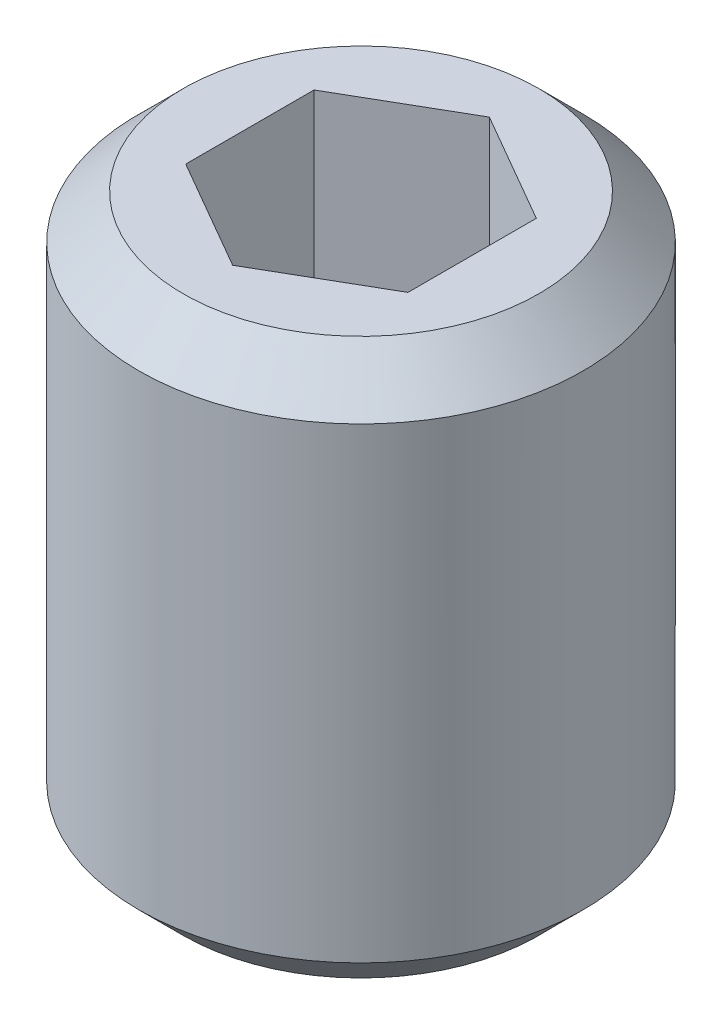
ISO-10303-21;
HEADER;
FILE_DESCRIPTION(('STEP AP214'),'2;1');
FILE_NAME('part.step','',(''),(''),'','','');
FILE_SCHEMA(('AUTOMOTIVE_DESIGN { 1 0 10303 214 1 1 1 1 }'));
ENDSEC;
DATA;
#1=APPLICATION_CONTEXT('core data for automotive mechanical design processes');
#2=APPLICATION_PROTOCOL_DEFINITION('international standard','automotive_design',2000,#1);
#3=PRODUCT_CONTEXT('',#1,'mechanical');
#4=PRODUCT('Part','Part','',(#3));
#5=PRODUCT_RELATED_PRODUCT_CATEGORY('part','',(#4));
#6=PRODUCT_DEFINITION_FORMATION('','',#4);
#7=PRODUCT_DEFINITION_CONTEXT('part definition',#1,'design');
#8=PRODUCT_DEFINITION('design','',#6,#7);
#9=PRODUCT_DEFINITION_SHAPE('','',#8);
#10=(LENGTH_UNIT() NAMED_UNIT(*) SI_UNIT(.MILLI.,.METRE.));
#11=(NAMED_UNIT(*) PLANE_ANGLE_UNIT() SI_UNIT($,.RADIAN.));
#12=(NAMED_UNIT(*) SI_UNIT($,.STERADIAN.) SOLID_ANGLE_UNIT());
#13=UNCERTAINTY_MEASURE_WITH_UNIT(LENGTH_MEASURE(1.E-05),#10,'distance_accuracy_value','');
#14=(GEOMETRIC_REPRESENTATION_CONTEXT(3) GLOBAL_UNCERTAINTY_ASSIGNED_CONTEXT((#13)) GLOBAL_UNIT_ASSIGNED_CONTEXT((#10,
#11,#12)) REPRESENTATION_CONTEXT('',''));
#15=CARTESIAN_POINT('',(0.,0.,0.));
#16=DIRECTION('',(0.,0.,1.));
#17=DIRECTION('',(1.,0.,0.));
#18=AXIS2_PLACEMENT_3D('',#15,#16,#17);
#19=CARTESIAN_POINT('',(0.,-10.,0.));
#20=DIRECTION('',(0.,1.,0.));
#21=DIRECTION('',(0.,0.,1.));
#22=AXIS2_PLACEMENT_3D('',#19,#20,#21);
#23=PLANE('',#22);
#24=CARTESIAN_POINT('',(0.,-10.,0.));
#25=DIRECTION('',(0.,1.,0.));
#26=DIRECTION('',(0.,0.,1.));
#27=AXIS2_PLACEMENT_3D('',#24,#25,#26);
#28=CIRCLE('',#27,3.2);
#29=CARTESIAN_POINT('',(0.,-10.,3.2));
#30=VERTEX_POINT('',#29);
#31=EDGE_CURVE('E147',#30,#30,#28,.F.);
#32=ORIENTED_EDGE('',*,*,#31,.T.);
#33=EDGE_LOOP('',(#32));
#34=FACE_BOUND('',#33,.T.);
#35=ADVANCED_FACE('F37',(#34),#23,.F.);
#36=CARTESIAN_POINT('',(0.,0.,0.));
#37=DIRECTION('',(0.,1.,0.));
#38=DIRECTION('',(0.,0.,1.));
#39=AXIS2_PLACEMENT_3D('',#36,#37,#38);
#40=CYLINDRICAL_SURFACE('',#39,4.);
#41=CARTESIAN_POINT('',(0.,-0.800000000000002,0.));
#42=DIRECTION('',(0.,-1.,0.));
#43=DIRECTION('',(0.,0.,-1.));
#44=AXIS2_PLACEMENT_3D('',#41,#42,#43);
#45=CIRCLE('',#44,4.);
#46=CARTESIAN_POINT('',(0.,-0.800000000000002,-4.));
#47=VERTEX_POINT('',#46);
#48=EDGE_CURVE('E11',#47,#47,#45,.T.);
#49=ORIENTED_EDGE('',*,*,#48,.T.);
#50=EDGE_LOOP('',(#49));
#51=FACE_BOUND('',#50,.T.);
#52=CARTESIAN_POINT('',(0.,-9.2,0.));
#53=DIRECTION('',(0.,1.,0.));
#54=DIRECTION('',(0.,0.,1.));
#55=AXIS2_PLACEMENT_3D('',#52,#53,#54);
#56=CIRCLE('',#55,4.);
#57=CARTESIAN_POINT('',(0.,-9.2,4.));
#58=VERTEX_POINT('',#57);
#59=EDGE_CURVE('E139',#58,#58,#56,.T.);
#60=ORIENTED_EDGE('',*,*,#59,.T.);
#61=EDGE_LOOP('',(#60));
#62=FACE_BOUND('',#61,.T.);
#63=ADVANCED_FACE('F167',(#51,#62),#40,.T.);
#64=CARTESIAN_POINT('',(0.,0.,0.));
#65=DIRECTION('',(0.,-1.,0.));
#66=DIRECTION('',(0.,0.,-1.));
#67=AXIS2_PLACEMENT_3D('',#64,#65,#66);
#68=PLANE('',#67);
#69=DIRECTION('',(0.866025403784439,0.,-0.5));
#70=VECTOR('',#69,1.);
#71=CARTESIAN_POINT('',(0.,0.,2.3094010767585));
#72=LINE('',#71,#70);
#73=CARTESIAN_POINT('',(0.,0.,2.3094010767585));
#74=VERTEX_POINT('',#73);
#75=CARTESIAN_POINT('',(2.,0.,1.15470053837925));
#76=VERTEX_POINT('',#75);
#77=EDGE_CURVE('E126',#74,#76,#72,.T.);
#78=ORIENTED_EDGE('',*,*,#77,.F.);
#79=DIRECTION('',(0.866025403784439,0.,0.5));
#80=VECTOR('',#79,1.);
#81=CARTESIAN_POINT('',(-2.,0.,1.15470053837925));
#82=LINE('',#81,#80);
#83=CARTESIAN_POINT('',(-2.,0.,1.15470053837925));
#84=VERTEX_POINT('',#83);
#85=EDGE_CURVE('E52',#84,#74,#82,.T.);
#86=ORIENTED_EDGE('',*,*,#85,.F.);
#87=DIRECTION('',(0.,0.,1.));
#88=VECTOR('',#87,1.);
#89=CARTESIAN_POINT('',(-2.,0.,-1.15470053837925));
#90=LINE('',#89,#88);
#91=CARTESIAN_POINT('',(-2.,0.,-1.15470053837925));
#92=VERTEX_POINT('',#91);
#93=EDGE_CURVE('E135',#92,#84,#90,.T.);
#94=ORIENTED_EDGE('',*,*,#93,.F.);
#95=DIRECTION('',(-0.866025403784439,0.,0.5));
#96=VECTOR('',#95,1.);
#97=CARTESIAN_POINT('',(0.,0.,-2.3094010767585));
#98=LINE('',#97,#96);
#99=CARTESIAN_POINT('',(0.,0.,-2.3094010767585));
#100=VERTEX_POINT('',#99);
#101=EDGE_CURVE('E133',#100,#92,#98,.T.);
#102=ORIENTED_EDGE('',*,*,#101,.F.);
#103=DIRECTION('',(-0.866025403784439,0.,-0.5));
#104=VECTOR('',#103,1.);
#105=CARTESIAN_POINT('',(2.,0.,-1.15470053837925));
#106=LINE('',#105,#104);
#107=CARTESIAN_POINT('',(2.,0.,-1.15470053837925));
#108=VERTEX_POINT('',#107);
#109=EDGE_CURVE('E100',#108,#100,#106,.T.);
#110=ORIENTED_EDGE('',*,*,#109,.F.);
#111=DIRECTION('',(0.,0.,-1.));
#112=VECTOR('',#111,1.);
#113=CARTESIAN_POINT('',(2.,0.,1.15470053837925));
#114=LINE('',#113,#112);
#115=EDGE_CURVE('E129',#76,#108,#114,.T.);
#116=ORIENTED_EDGE('',*,*,#115,.F.);
#117=EDGE_LOOP('',(#78,#86,#94,#102,#110,#116));
#118=FACE_BOUND('',#117,.T.);
#119=CARTESIAN_POINT('',(0.,0.,0.));
#120=DIRECTION('',(0.,-1.,0.));
#121=DIRECTION('',(0.,0.,-1.));
#122=AXIS2_PLACEMENT_3D('',#119,#120,#121);
#123=CIRCLE('',#122,3.2);
#124=CARTESIAN_POINT('',(0.,0.,-3.2));
#125=VERTEX_POINT('',#124);
#126=EDGE_CURVE('E45',#125,#125,#123,.F.);
#127=ORIENTED_EDGE('',*,*,#126,.T.);
#128=EDGE_LOOP('',(#127));
#129=FACE_BOUND('',#128,.T.);
#130=ADVANCED_FACE('F152',(#118,#129),#68,.F.);
#131=CARTESIAN_POINT('',(0.,-9.2,0.));
#132=DIRECTION('',(0.,1.,0.));
#133=DIRECTION('',(0.,0.,1.));
#134=AXIS2_PLACEMENT_3D('',#131,#132,#133);
#135=CONICAL_SURFACE('',#134,4.,0.785398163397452);
#136=CARTESIAN_POINT('',(0.,-10.,3.2));
#137=CARTESIAN_POINT('',(0.,-9.99166666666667,3.20833333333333));
#138=CARTESIAN_POINT('',(0.,-9.98333333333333,3.21666666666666));
#139=CARTESIAN_POINT('',(0.,-9.96666666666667,3.23333333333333));
#140=CARTESIAN_POINT('',(0.,-9.95833333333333,3.24166666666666));
#141=CARTESIAN_POINT('',(0.,-9.94166666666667,3.25833333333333));
#142=CARTESIAN_POINT('',(0.,-9.93333333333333,3.26666666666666));
#143=CARTESIAN_POINT('',(0.,-9.91666666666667,3.28333333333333));
#144=CARTESIAN_POINT('',(0.,-9.90833333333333,3.29166666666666));
#145=CARTESIAN_POINT('',(0.,-9.89166666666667,3.30833333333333));
#146=CARTESIAN_POINT('',(0.,-9.88333333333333,3.31666666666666));
#147=CARTESIAN_POINT('',(0.,-9.86666666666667,3.33333333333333));
#148=CARTESIAN_POINT('',(0.,-9.85833333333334,3.34166666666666));
#149=CARTESIAN_POINT('',(0.,-9.84166666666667,3.35833333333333));
#150=CARTESIAN_POINT('',(0.,-9.83333333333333,3.36666666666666));
#151=CARTESIAN_POINT('',(0.,-9.81666666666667,3.38333333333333));
#152=CARTESIAN_POINT('',(0.,-9.80833333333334,3.39166666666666));
#153=CARTESIAN_POINT('',(0.,-9.79166666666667,3.40833333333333));
#154=CARTESIAN_POINT('',(0.,-9.78333333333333,3.41666666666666));
#155=CARTESIAN_POINT('',(0.,-9.76666666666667,3.43333333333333));
#156=CARTESIAN_POINT('',(0.,-9.75833333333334,3.44166666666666));
#157=CARTESIAN_POINT('',(0.,-9.74166666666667,3.45833333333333));
#158=CARTESIAN_POINT('',(0.,-9.73333333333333,3.46666666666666));
#159=CARTESIAN_POINT('',(0.,-9.71666666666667,3.48333333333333));
#160=CARTESIAN_POINT('',(0.,-9.70833333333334,3.49166666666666));
#161=CARTESIAN_POINT('',(0.,-9.69166666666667,3.50833333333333));
#162=CARTESIAN_POINT('',(0.,-9.68333333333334,3.51666666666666));
#163=CARTESIAN_POINT('',(0.,-9.66666666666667,3.53333333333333));
#164=CARTESIAN_POINT('',(0.,-9.65833333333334,3.54166666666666));
#165=CARTESIAN_POINT('',(0.,-9.64166666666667,3.55833333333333));
#166=CARTESIAN_POINT('',(0.,-9.63333333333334,3.56666666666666));
#167=CARTESIAN_POINT('',(0.,-9.61666666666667,3.58333333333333));
#168=CARTESIAN_POINT('',(0.,-9.60833333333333,3.59166666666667));
#169=CARTESIAN_POINT('',(0.,-9.59166666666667,3.60833333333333));
#170=CARTESIAN_POINT('',(0.,-9.58333333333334,3.61666666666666));
#171=CARTESIAN_POINT('',(0.,-9.56666666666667,3.63333333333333));
#172=CARTESIAN_POINT('',(0.,-9.55833333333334,3.64166666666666));
#173=CARTESIAN_POINT('',(0.,-9.54166666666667,3.65833333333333));
#174=CARTESIAN_POINT('',(0.,-9.53333333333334,3.66666666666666));
#175=CARTESIAN_POINT('',(0.,-9.51666666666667,3.68333333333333));
#176=CARTESIAN_POINT('',(0.,-9.50833333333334,3.69166666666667));
#177=CARTESIAN_POINT('',(0.,-9.49166666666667,3.70833333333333));
#178=CARTESIAN_POINT('',(0.,-9.48333333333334,3.71666666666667));
#179=CARTESIAN_POINT('',(0.,-9.46666666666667,3.73333333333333));
#180=CARTESIAN_POINT('',(0.,-9.45833333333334,3.74166666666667));
#181=CARTESIAN_POINT('',(0.,-9.44166666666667,3.75833333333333));
#182=CARTESIAN_POINT('',(0.,-9.43333333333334,3.76666666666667));
#183=CARTESIAN_POINT('',(0.,-9.41666666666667,3.78333333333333));
#184=CARTESIAN_POINT('',(0.,-9.40833333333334,3.79166666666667));
#185=CARTESIAN_POINT('',(0.,-9.39166666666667,3.80833333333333));
#186=CARTESIAN_POINT('',(0.,-9.38333333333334,3.81666666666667));
#187=CARTESIAN_POINT('',(0.,-9.36666666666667,3.83333333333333));
#188=CARTESIAN_POINT('',(0.,-9.35833333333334,3.84166666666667));
#189=CARTESIAN_POINT('',(0.,-9.34166666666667,3.85833333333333));
#190=CARTESIAN_POINT('',(0.,-9.33333333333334,3.86666666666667));
#191=CARTESIAN_POINT('',(0.,-9.31666666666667,3.88333333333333));
#192=CARTESIAN_POINT('',(0.,-9.30833333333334,3.89166666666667));
#193=CARTESIAN_POINT('',(0.,-9.29166666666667,3.90833333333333));
#194=CARTESIAN_POINT('',(0.,-9.28333333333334,3.91666666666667));
#195=CARTESIAN_POINT('',(0.,-9.26666666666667,3.93333333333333));
#196=CARTESIAN_POINT('',(0.,-9.25833333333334,3.94166666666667));
#197=CARTESIAN_POINT('',(0.,-9.24166666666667,3.95833333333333));
#198=CARTESIAN_POINT('',(0.,-9.23333333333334,3.96666666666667));
#199=CARTESIAN_POINT('',(0.,-9.21666666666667,3.98333333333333));
#200=CARTESIAN_POINT('',(0.,-9.20833333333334,3.99166666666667));
#201=CARTESIAN_POINT('',(0.,-9.2,4.));
#202=B_SPLINE_CURVE_WITH_KNOTS('',3,(#136,#137,#138,#139,#140,#141,#142,#143,#144,#145,#146,
#147,#148,#149,#150,#151,#152,#153,#154,#155,#156,#157,#158,#159,#160,#161,#162,#163,#164,#165,
#166,#167,#168,#169,#170,#171,#172,#173,#174,#175,#176,#177,#178,#179,#180,#181,#182,#183,#184,
#185,#186,#187,#188,#189,#190,#191,#192,#193,#194,#195,#196,#197,#198,#199,#200,#201),
.UNSPECIFIED.,.F.,.F.,(4,2,2,2,2,2,2,2,2,2,2,2,2,2,2,2,2,2,2,2,2,2,2,2,2,2,2,2,2,2,2,2,4),(0.,
0.0353553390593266,0.0707106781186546,0.106066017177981,0.141421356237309,0.176776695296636,
0.212132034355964,0.247487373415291,0.282842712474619,0.318198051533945,0.353553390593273,
0.3889087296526,0.424264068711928,0.459619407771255,0.494974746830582,0.53033008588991,
0.565685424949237,0.601040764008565,0.636396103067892,0.67175144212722,0.707106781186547,
0.742462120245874,0.777817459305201,0.813172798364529,0.848528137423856,0.883883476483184,
0.919238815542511,0.954594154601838,0.989949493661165,1.02530483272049,1.06066017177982,
1.09601551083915,1.13137084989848),.UNSPECIFIED.);
#203=EDGE_CURVE('BSEAM156',#30,#58,#202,.T.);
#204=ORIENTED_EDGE('',*,*,#31,.F.);
#205=ORIENTED_EDGE('',*,*,#59,.F.);
#206=ORIENTED_EDGE('',*,*,#203,.T.);
#207=ORIENTED_EDGE('',*,*,#203,.F.);
#208=EDGE_LOOP('',(#204,#206,#205,#207));
#209=FACE_BOUND('',#208,.T.);
#210=ADVANCED_FACE('F156',(#209),#135,.T.);
#211=CARTESIAN_POINT('',(0.,0.,0.));
#212=DIRECTION('',(0.,-1.,0.));
#213=DIRECTION('',(0.,0.,-1.));
#214=AXIS2_PLACEMENT_3D('',#211,#212,#213);
#215=CONICAL_SURFACE('',#214,3.2,0.785398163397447);
#216=ORIENTED_EDGE('',*,*,#48,.F.);
#217=EDGE_LOOP('',(#216));
#218=FACE_BOUND('',#217,.T.);
#219=ORIENTED_EDGE('',*,*,#126,.F.);
#220=EDGE_LOOP('',(#219));
#221=FACE_BOUND('',#220,.T.);
#222=ADVANCED_FACE('F39',(#218,#221),#215,.T.);
#223=CARTESIAN_POINT('',(-2.,-5.,1.15470053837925));
#224=DIRECTION('',(-0.5,0.,0.866025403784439));
#225=DIRECTION('',(0.866025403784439,0.,0.5));
#226=AXIS2_PLACEMENT_3D('',#223,#224,#225);
#227=PLANE('',#226);
#228=ORIENTED_EDGE('',*,*,#85,.T.);
#229=DIRECTION('',(0.,1.,0.));
#230=VECTOR('',#229,1.);
#231=CARTESIAN_POINT('',(0.,-5.,2.3094010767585));
#232=LINE('',#231,#230);
#233=CARTESIAN_POINT('',(0.,-5.,2.3094010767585));
#234=VERTEX_POINT('',#233);
#235=EDGE_CURVE('E82',#234,#74,#232,.T.);
#236=ORIENTED_EDGE('',*,*,#235,.F.);
#237=DIRECTION('',(0.866025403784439,0.,0.5));
#238=VECTOR('',#237,1.);
#239=CARTESIAN_POINT('',(-2.,-5.,1.15470053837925));
#240=LINE('',#239,#238);
#241=CARTESIAN_POINT('',(-2.,-5.,1.15470053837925));
#242=VERTEX_POINT('',#241);
#243=EDGE_CURVE('E137',#242,#234,#240,.T.);
#244=ORIENTED_EDGE('',*,*,#243,.F.);
#245=DIRECTION('',(0.,1.,0.));
#246=VECTOR('',#245,1.);
#247=CARTESIAN_POINT('',(-2.,-5.,1.15470053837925));
#248=LINE('',#247,#246);
#249=EDGE_CURVE('E60',#242,#84,#248,.T.);
#250=ORIENTED_EDGE('',*,*,#249,.T.);
#251=EDGE_LOOP('',(#228,#236,#244,#250));
#252=FACE_BOUND('',#251,.T.);
#253=ADVANCED_FACE('F155',(#252),#227,.F.);
#254=CARTESIAN_POINT('',(-2.,-5.,-1.15470053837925));
#255=DIRECTION('',(-1.,0.,0.));
#256=DIRECTION('',(0.,0.,1.));
#257=AXIS2_PLACEMENT_3D('',#254,#255,#256);
#258=PLANE('',#257);
#259=ORIENTED_EDGE('',*,*,#93,.T.);
#260=ORIENTED_EDGE('',*,*,#249,.F.);
#261=DIRECTION('',(0.,0.,1.));
#262=VECTOR('',#261,1.);
#263=CARTESIAN_POINT('',(-2.,-5.,-1.15470053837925));
#264=LINE('',#263,#262);
#265=CARTESIAN_POINT('',(-2.,-5.,-1.15470053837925));
#266=VERTEX_POINT('',#265);
#267=EDGE_CURVE('E112',#266,#242,#264,.T.);
#268=ORIENTED_EDGE('',*,*,#267,.F.);
#269=DIRECTION('',(0.,1.,0.));
#270=VECTOR('',#269,1.);
#271=CARTESIAN_POINT('',(-2.,-5.,-1.15470053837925));
#272=LINE('',#271,#270);
#273=EDGE_CURVE('E104',#266,#92,#272,.T.);
#274=ORIENTED_EDGE('',*,*,#273,.T.);
#275=EDGE_LOOP('',(#259,#260,#268,#274));
#276=FACE_BOUND('',#275,.T.);
#277=ADVANCED_FACE('F162',(#276),#258,.F.);
#278=CARTESIAN_POINT('',(0.,-5.,-2.3094010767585));
#279=DIRECTION('',(-0.5,0.,-0.866025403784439));
#280=DIRECTION('',(-0.866025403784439,0.,0.5));
#281=AXIS2_PLACEMENT_3D('',#278,#279,#280);
#282=PLANE('',#281);
#283=ORIENTED_EDGE('',*,*,#101,.T.);
#284=ORIENTED_EDGE('',*,*,#273,.F.);
#285=DIRECTION('',(-0.866025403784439,0.,0.5));
#286=VECTOR('',#285,1.);
#287=CARTESIAN_POINT('',(0.,-5.,-2.3094010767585));
#288=LINE('',#287,#286);
#289=CARTESIAN_POINT('',(0.,-5.,-2.3094010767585));
#290=VERTEX_POINT('',#289);
#291=EDGE_CURVE('E108',#290,#266,#288,.T.);
#292=ORIENTED_EDGE('',*,*,#291,.F.);
#293=DIRECTION('',(0.,1.,0.));
#294=VECTOR('',#293,1.);
#295=CARTESIAN_POINT('',(0.,-5.,-2.3094010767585));
#296=LINE('',#295,#294);
#297=EDGE_CURVE('E93',#290,#100,#296,.T.);
#298=ORIENTED_EDGE('',*,*,#297,.T.);
#299=EDGE_LOOP('',(#283,#284,#292,#298));
#300=FACE_BOUND('',#299,.T.);
#301=ADVANCED_FACE('F109',(#300),#282,.F.);
#302=CARTESIAN_POINT('',(2.,-5.,-1.15470053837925));
#303=DIRECTION('',(0.5,0.,-0.866025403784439));
#304=DIRECTION('',(-0.866025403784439,0.,-0.5));
#305=AXIS2_PLACEMENT_3D('',#302,#303,#304);
#306=PLANE('',#305);
#307=ORIENTED_EDGE('',*,*,#109,.T.);
#308=ORIENTED_EDGE('',*,*,#297,.F.);
#309=DIRECTION('',(-0.866025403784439,0.,-0.5));
#310=VECTOR('',#309,1.);
#311=CARTESIAN_POINT('',(2.,-5.,-1.15470053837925));
#312=LINE('',#311,#310);
#313=CARTESIAN_POINT('',(2.,-5.,-1.15470053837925));
#314=VERTEX_POINT('',#313);
#315=EDGE_CURVE('E97',#314,#290,#312,.T.);
#316=ORIENTED_EDGE('',*,*,#315,.F.);
#317=DIRECTION('',(0.,1.,0.));
#318=VECTOR('',#317,1.);
#319=CARTESIAN_POINT('',(2.,-5.,-1.15470053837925));
#320=LINE('',#319,#318);
#321=EDGE_CURVE('E105',#314,#108,#320,.T.);
#322=ORIENTED_EDGE('',*,*,#321,.T.);
#323=EDGE_LOOP('',(#307,#308,#316,#322));
#324=FACE_BOUND('',#323,.T.);
#325=ADVANCED_FACE('F95',(#324),#306,.F.);
#326=CARTESIAN_POINT('',(2.,-5.,1.15470053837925));
#327=DIRECTION('',(1.,0.,0.));
#328=DIRECTION('',(0.,0.,-1.));
#329=AXIS2_PLACEMENT_3D('',#326,#327,#328);
#330=PLANE('',#329);
#331=ORIENTED_EDGE('',*,*,#115,.T.);
#332=ORIENTED_EDGE('',*,*,#321,.F.);
#333=DIRECTION('',(0.,0.,-1.));
#334=VECTOR('',#333,1.);
#335=CARTESIAN_POINT('',(2.,-5.,1.15470053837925));
#336=LINE('',#335,#334);
#337=CARTESIAN_POINT('',(2.,-5.,1.15470053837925));
#338=VERTEX_POINT('',#337);
#339=EDGE_CURVE('E118',#338,#314,#336,.T.);
#340=ORIENTED_EDGE('',*,*,#339,.F.);
#341=DIRECTION('',(0.,1.,0.));
#342=VECTOR('',#341,1.);
#343=CARTESIAN_POINT('',(2.,-5.,1.15470053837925));
#344=LINE('',#343,#342);
#345=EDGE_CURVE('E142',#338,#76,#344,.T.);
#346=ORIENTED_EDGE('',*,*,#345,.T.);
#347=EDGE_LOOP('',(#331,#332,#340,#346));
#348=FACE_BOUND('',#347,.T.);
#349=ADVANCED_FACE('F182',(#348),#330,.F.);
#350=CARTESIAN_POINT('',(0.,-5.,2.3094010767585));
#351=DIRECTION('',(0.5,0.,0.866025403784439));
#352=DIRECTION('',(0.866025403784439,0.,-0.5));
#353=AXIS2_PLACEMENT_3D('',#350,#351,#352);
#354=PLANE('',#353);
#355=ORIENTED_EDGE('',*,*,#77,.T.);
#356=ORIENTED_EDGE('',*,*,#345,.F.);
#357=DIRECTION('',(0.866025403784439,0.,-0.5));
#358=VECTOR('',#357,1.);
#359=CARTESIAN_POINT('',(0.,-5.,2.3094010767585));
#360=LINE('',#359,#358);
#361=EDGE_CURVE('E120',#234,#338,#360,.T.);
#362=ORIENTED_EDGE('',*,*,#361,.F.);
#363=ORIENTED_EDGE('',*,*,#235,.T.);
#364=EDGE_LOOP('',(#355,#356,#362,#363));
#365=FACE_BOUND('',#364,.T.);
#366=ADVANCED_FACE('F179',(#365),#354,.F.);
#367=CARTESIAN_POINT('',(2.,-5.,3.46410161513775));
#368=DIRECTION('',(0.,1.,0.));
#369=DIRECTION('',(0.,0.,1.));
#370=AXIS2_PLACEMENT_3D('',#367,#368,#369);
#371=PLANE('',#370);
#372=ORIENTED_EDGE('',*,*,#243,.T.);
#373=ORIENTED_EDGE('',*,*,#361,.T.);
#374=ORIENTED_EDGE('',*,*,#339,.T.);
#375=ORIENTED_EDGE('',*,*,#315,.T.);
#376=ORIENTED_EDGE('',*,*,#291,.T.);
#377=ORIENTED_EDGE('',*,*,#267,.T.);
#378=EDGE_LOOP('',(#372,#373,#374,#375,#376,#377));
#379=FACE_BOUND('',#378,.T.);
#380=ADVANCED_FACE('F115',(#379),#371,.T.);
#381=CLOSED_SHELL('',(#35,#63,#130,#210,#222,#253,#277,#301,#325,#349,#366,#380));
#382=MANIFOLD_SOLID_BREP('B2',#381);
#383=ADVANCED_BREP_SHAPE_REPRESENTATION('',(#18,#382),#14);
#384=SHAPE_DEFINITION_REPRESENTATION(#9,#383);
ENDSEC;
END-ISO-10303-21;
